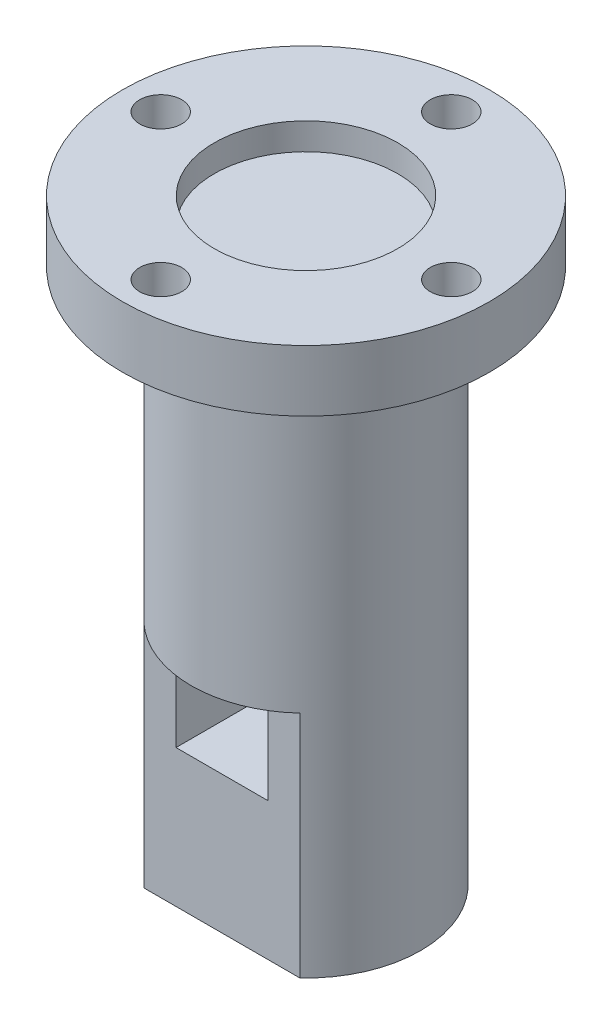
from build123d import *

# Parameters (mm, degrees)
SKETCH1_R           = 24
BOSS_EXTRUDE1_DEPTH = 8
SKETCH8_R           = 15
BOSS_EXTRUDE3_DEPTH = 70
CUT_EXTRUDE4_START  = -30
CUT_EXTRUDE4_DEPTH  = 30
SKETCH10_W          = 12
SKETCH10_H          = 12
CUT_EXTRUDE5_DEPTH  = 12
SKETCH11_R          = 12
CUT_EXTRUDE6_DEPTH  = 3.5
SKETCH12_R          = 2.75
CUT_EXTRUDE7_DEPTH  = 5.5


with BuildPart() as part:
    # Sketch1 → Boss-Extrude1 (new body)
    with BuildSketch(Plane(origin=(0, 0, 0), x_dir=(1, 0, 0), z_dir=(0, 1, 0))):
        with Locations(Location((0, 0, 0), (0, 0, 270))):
            Circle(SKETCH1_R)
    extrude(amount=BOSS_EXTRUDE1_DEPTH)

    # Sketch8 → Boss-Extrude3 (add)
    with BuildSketch(Plane.XZ):
        with Locations(Location((0, 0, 0), (0, 0, 90))):
            Circle(SKETCH8_R)
    extrude(amount=BOSS_EXTRUDE3_DEPTH)

    # Sketch9 → Cut-Extrude4 (cut)
    with BuildSketch(Plane.XZ.offset(70).offset(CUT_EXTRUDE4_START)):
        with BuildLine():
            Line((-10.198039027, 11), (10.198039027, 11))
            ThreePointArc((10.198039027, 11), (0, 15), (-10.198039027, 11))
        make_face()
    extrude(amount=CUT_EXTRUDE4_DEPTH, mode=Mode.SUBTRACT)

    # Sketch10 → Cut-Extrude5 (cut)
    with BuildSketch(Plane.XY.offset(11)):
        with Locations((0, -46)):
            Rectangle(SKETCH10_W, SKETCH10_H)
    extrude(amount=-CUT_EXTRUDE5_DEPTH, mode=Mode.SUBTRACT)

    # Sketch11 → Cut-Extrude6 (cut)
    with BuildSketch(Plane(origin=(0, 8, 0), x_dir=(1, 0, 0), z_dir=(0, 1, 0))):
        with Locations(Location((0, 0, 0), (0, 0, 270))):
            Circle(SKETCH11_R)
    extrude(amount=-CUT_EXTRUDE6_DEPTH, mode=Mode.SUBTRACT)

    # Sketch12 → Cut-Extrude7 (cut)
    with BuildSketch(Plane(origin=(0, 8, 0), x_dir=(1, 0, 0), z_dir=(0, 1, 0))):
        with Locations(Location((19, 0, 0), (0, 0, 270))):
            Circle(SKETCH12_R)
        with Locations(Location((0, -19, 0), (0, 0, 270))):
            Circle(SKETCH12_R)
        with Locations(Location((-19, 0, 0), (0, 0, 270))):
            Circle(SKETCH12_R)
        with Locations(Location((0, 19, 0), (0, 0, 270))):
            Circle(SKETCH12_R)
    extrude(amount=-CUT_EXTRUDE7_DEPTH, mode=Mode.SUBTRACT)


solid = part.part
